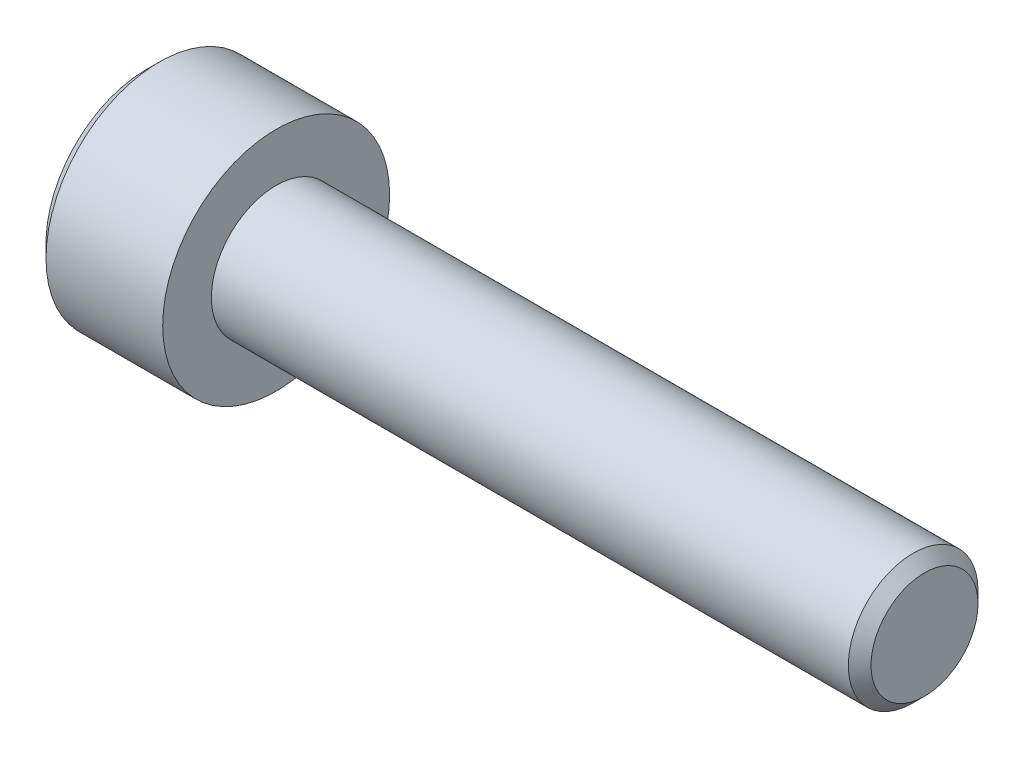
from build123d import *

# Parameters (mm, degrees)
SKETCH1_R           = 3.5
BOSS_EXTRUDE1_DEPTH = 4
CUT_EXTRUDE1_DEPTH  = 2.2
CHAMFER1_SIZE       = 0.4
SKETCH4_R           = 2
BOSS_EXTRUDE2_DEPTH = 20
CHAMFER2_SIZE       = 0.35


with BuildPart() as part:
    # Sketch1 → Boss-Extrude1 (new body)
    with BuildSketch(Plane(origin=(0, 0, 0), x_dir=(0, 0, -1), z_dir=(1, 0, 0))):
        Circle(SKETCH1_R)
    extrude(amount=BOSS_EXTRUDE1_DEPTH)

    # Sketch2 → Cut-Extrude1 (cut)
    with BuildSketch(Plane.ZY):
        Polygon((-1.732050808, 0), (-0.866025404, -1.5), (0.866025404, -1.5), (1.732050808, 0), (0.866025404, 1.5), (-0.866025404, 1.5), align=None)
    extrude(amount=-CUT_EXTRUDE1_DEPTH, mode=Mode.SUBTRACT)

    # Chamfer1
    chamfer1_edges = [part.edges().sort_by_distance(p)[0] for p in [
        (0, 0, 3.5),
    ]]
    chamfer(chamfer1_edges, length=CHAMFER1_SIZE)

    # Sketch4 → Boss-Extrude2 (add)
    with BuildSketch(Plane(origin=(4, 0, 0), x_dir=(0, 0, -1), z_dir=(1, 0, 0))):
        Circle(SKETCH4_R)
    extrude(amount=BOSS_EXTRUDE2_DEPTH)

    # Chamfer2
    chamfer2_edges = [part.edges().sort_by_distance(p)[0] for p in [
        (24, 0, 2),
    ]]
    chamfer(chamfer2_edges, length=CHAMFER2_SIZE)


solid = part.part
